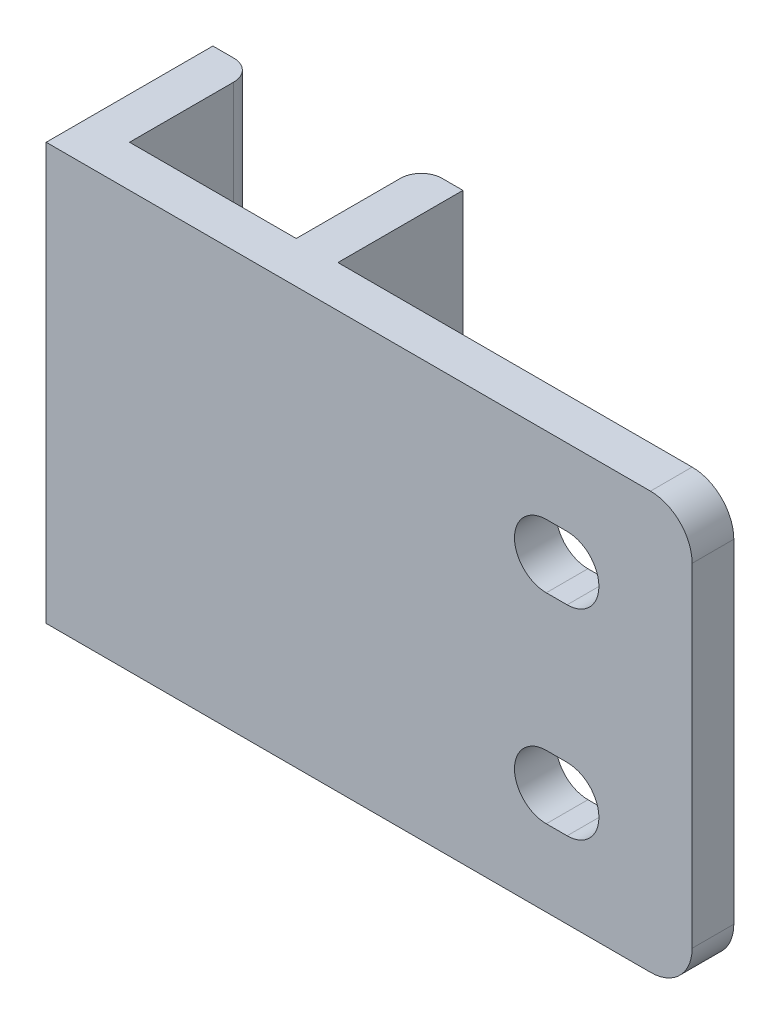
ISO-10303-21;
HEADER;
FILE_DESCRIPTION(('STEP AP214'),'2;1');
FILE_NAME('part.step','',(''),(''),'','','');
FILE_SCHEMA(('AUTOMOTIVE_DESIGN { 1 0 10303 214 1 1 1 1 }'));
ENDSEC;
DATA;
#1=APPLICATION_CONTEXT('core data for automotive mechanical design processes');
#2=APPLICATION_PROTOCOL_DEFINITION('international standard','automotive_design',2000,#1);
#3=PRODUCT_CONTEXT('',#1,'mechanical');
#4=PRODUCT('Part','Part','',(#3));
#5=PRODUCT_RELATED_PRODUCT_CATEGORY('part','',(#4));
#6=PRODUCT_DEFINITION_FORMATION('','',#4);
#7=PRODUCT_DEFINITION_CONTEXT('part definition',#1,'design');
#8=PRODUCT_DEFINITION('design','',#6,#7);
#9=PRODUCT_DEFINITION_SHAPE('','',#8);
#10=(LENGTH_UNIT() NAMED_UNIT(*) SI_UNIT(.MILLI.,.METRE.));
#11=(NAMED_UNIT(*) PLANE_ANGLE_UNIT() SI_UNIT($,.RADIAN.));
#12=(NAMED_UNIT(*) SI_UNIT($,.STERADIAN.) SOLID_ANGLE_UNIT());
#13=UNCERTAINTY_MEASURE_WITH_UNIT(LENGTH_MEASURE(1.E-05),#10,'distance_accuracy_value','');
#14=(GEOMETRIC_REPRESENTATION_CONTEXT(3) GLOBAL_UNCERTAINTY_ASSIGNED_CONTEXT((#13)) GLOBAL_UNIT_ASSIGNED_CONTEXT((#10,
#11,#12)) REPRESENTATION_CONTEXT('',''));
#15=CARTESIAN_POINT('',(0.,0.,0.));
#16=DIRECTION('',(0.,0.,1.));
#17=DIRECTION('',(1.,0.,0.));
#18=AXIS2_PLACEMENT_3D('',#15,#16,#17);
#19=CARTESIAN_POINT('',(0.,0.,0.));
#20=DIRECTION('',(0.,0.,-1.));
#21=DIRECTION('',(-1.,0.,0.));
#22=AXIS2_PLACEMENT_3D('',#19,#20,#21);
#23=PLANE('',#22);
#24=DIRECTION('',(0.,-1.,0.));
#25=VECTOR('',#24,1.);
#26=CARTESIAN_POINT('',(-20.5,10.,0.));
#27=LINE('',#26,#25);
#28=CARTESIAN_POINT('',(-20.5,10.,0.));
#29=VERTEX_POINT('',#28);
#30=CARTESIAN_POINT('',(-20.5,-10.,0.));
#31=VERTEX_POINT('',#30);
#32=EDGE_CURVE('E214',#29,#31,#27,.T.);
#33=ORIENTED_EDGE('',*,*,#32,.T.);
#34=DIRECTION('',(1.,0.,0.));
#35=VECTOR('',#34,1.);
#36=CARTESIAN_POINT('',(0.500000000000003,-10.,0.));
#37=LINE('',#36,#35);
#38=CARTESIAN_POINT('',(-28.5,-10.,0.));
#39=VERTEX_POINT('',#38);
#40=EDGE_CURVE('E303',#39,#31,#37,.T.);
#41=ORIENTED_EDGE('',*,*,#40,.F.);
#42=DIRECTION('',(0.,1.,0.));
#43=VECTOR('',#42,1.);
#44=CARTESIAN_POINT('',(-28.5,10.,0.));
#45=LINE('',#44,#43);
#46=CARTESIAN_POINT('',(-28.5,10.,0.));
#47=VERTEX_POINT('',#46);
#48=EDGE_CURVE('E220',#39,#47,#45,.T.);
#49=ORIENTED_EDGE('',*,*,#48,.T.);
#50=DIRECTION('',(-1.,0.,0.));
#51=VECTOR('',#50,1.);
#52=CARTESIAN_POINT('',(-30.5,10.,0.));
#53=LINE('',#52,#51);
#54=EDGE_CURVE('E312',#29,#47,#53,.T.);
#55=ORIENTED_EDGE('',*,*,#54,.F.);
#56=EDGE_LOOP('',(#33,#41,#49,#55));
#57=FACE_BOUND('',#56,.T.);
#58=ADVANCED_FACE('F35',(#57),#23,.T.);
#59=DIRECTION('',(0.,1.,0.));
#60=VECTOR('',#59,1.);
#61=CARTESIAN_POINT('',(0.499999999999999,10.,0.));
#62=LINE('',#61,#60);
#63=CARTESIAN_POINT('',(0.500000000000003,-8.,0.));
#64=VERTEX_POINT('',#63);
#65=CARTESIAN_POINT('',(0.5,8.,0.));
#66=VERTEX_POINT('',#65);
#67=EDGE_CURVE('E299',#64,#66,#62,.T.);
#68=ORIENTED_EDGE('',*,*,#67,.F.);
#69=CARTESIAN_POINT('',(-1.5,-8.,0.));
#70=DIRECTION('',(0.,0.,-1.));
#71=DIRECTION('',(-1.,0.,0.));
#72=AXIS2_PLACEMENT_3D('',#69,#70,#71);
#73=CIRCLE('',#72,2.);
#74=CARTESIAN_POINT('',(-1.5,-10.,0.));
#75=VERTEX_POINT('',#74);
#76=EDGE_CURVE('E346',#64,#75,#73,.T.);
#77=ORIENTED_EDGE('',*,*,#76,.T.);
#78=CARTESIAN_POINT('',(-18.5,-10.,0.));
#79=VERTEX_POINT('',#78);
#80=EDGE_CURVE('E315',#79,#75,#37,.T.);
#81=ORIENTED_EDGE('',*,*,#80,.F.);
#82=DIRECTION('',(0.,1.,0.));
#83=VECTOR('',#82,1.);
#84=CARTESIAN_POINT('',(-18.5,10.,0.));
#85=LINE('',#84,#83);
#86=CARTESIAN_POINT('',(-18.5,10.,0.));
#87=VERTEX_POINT('',#86);
#88=EDGE_CURVE('E197',#79,#87,#85,.T.);
#89=ORIENTED_EDGE('',*,*,#88,.T.);
#90=CARTESIAN_POINT('',(-1.5,10.,0.));
#91=VERTEX_POINT('',#90);
#92=EDGE_CURVE('E313',#91,#87,#53,.T.);
#93=ORIENTED_EDGE('',*,*,#92,.F.);
#94=CARTESIAN_POINT('',(-1.5,8.,0.));
#95=DIRECTION('',(0.,0.,-1.));
#96=DIRECTION('',(-1.,0.,0.));
#97=AXIS2_PLACEMENT_3D('',#94,#95,#96);
#98=CIRCLE('',#97,2.);
#99=EDGE_CURVE('E344',#91,#66,#98,.T.);
#100=ORIENTED_EDGE('',*,*,#99,.T.);
#101=EDGE_LOOP('',(#68,#77,#81,#89,#93,#100));
#102=FACE_BOUND('',#101,.T.);
#103=DIRECTION('',(-1.,0.,0.));
#104=VECTOR('',#103,1.);
#105=CARTESIAN_POINT('',(-6.5,6.325,0.));
#106=LINE('',#105,#104);
#107=CARTESIAN_POINT('',(-5.5,6.325,0.));
#108=VERTEX_POINT('',#107);
#109=CARTESIAN_POINT('',(-6.5,6.325,0.));
#110=VERTEX_POINT('',#109);
#111=EDGE_CURVE('E272',#108,#110,#106,.T.);
#112=ORIENTED_EDGE('',*,*,#111,.T.);
#113=CARTESIAN_POINT('',(-6.5,4.8,0.));
#114=DIRECTION('',(0.,0.,1.));
#115=DIRECTION('',(1.,0.,0.));
#116=AXIS2_PLACEMENT_3D('',#113,#114,#115);
#117=CIRCLE('',#116,1.525);
#118=CARTESIAN_POINT('',(-6.5,3.275,0.));
#119=VERTEX_POINT('',#118);
#120=EDGE_CURVE('E268',#110,#119,#117,.T.);
#121=ORIENTED_EDGE('',*,*,#120,.T.);
#122=DIRECTION('',(1.,0.,0.));
#123=VECTOR('',#122,1.);
#124=CARTESIAN_POINT('',(-6.5,3.275,0.));
#125=LINE('',#124,#123);
#126=CARTESIAN_POINT('',(-5.5,3.275,0.));
#127=VERTEX_POINT('',#126);
#128=EDGE_CURVE('E282',#119,#127,#125,.T.);
#129=ORIENTED_EDGE('',*,*,#128,.T.);
#130=CARTESIAN_POINT('',(-5.5,4.8,0.));
#131=DIRECTION('',(0.,0.,1.));
#132=DIRECTION('',(1.,0.,0.));
#133=AXIS2_PLACEMENT_3D('',#130,#131,#132);
#134=CIRCLE('',#133,1.525);
#135=EDGE_CURVE('E285',#127,#108,#134,.T.);
#136=ORIENTED_EDGE('',*,*,#135,.T.);
#137=EDGE_LOOP('',(#112,#121,#129,#136));
#138=FACE_BOUND('',#137,.T.);
#139=DIRECTION('',(-1.,0.,0.));
#140=VECTOR('',#139,1.);
#141=CARTESIAN_POINT('',(-6.49999999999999,-3.275,0.));
#142=LINE('',#141,#140);
#143=CARTESIAN_POINT('',(-5.5,-3.275,0.));
#144=VERTEX_POINT('',#143);
#145=CARTESIAN_POINT('',(-6.49999999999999,-3.275,0.));
#146=VERTEX_POINT('',#145);
#147=EDGE_CURVE('E241',#144,#146,#142,.T.);
#148=ORIENTED_EDGE('',*,*,#147,.T.);
#149=CARTESIAN_POINT('',(-6.49999999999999,-4.8,0.));
#150=DIRECTION('',(0.,0.,1.));
#151=DIRECTION('',(1.,0.,0.));
#152=AXIS2_PLACEMENT_3D('',#149,#150,#151);
#153=CIRCLE('',#152,1.525);
#154=CARTESIAN_POINT('',(-6.49999999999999,-6.325,0.));
#155=VERTEX_POINT('',#154);
#156=EDGE_CURVE('E236',#146,#155,#153,.T.);
#157=ORIENTED_EDGE('',*,*,#156,.T.);
#158=DIRECTION('',(1.,0.,0.));
#159=VECTOR('',#158,1.);
#160=CARTESIAN_POINT('',(-6.49999999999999,-6.325,0.));
#161=LINE('',#160,#159);
#162=CARTESIAN_POINT('',(-5.5,-6.325,0.));
#163=VERTEX_POINT('',#162);
#164=EDGE_CURVE('E251',#155,#163,#161,.T.);
#165=ORIENTED_EDGE('',*,*,#164,.T.);
#166=CARTESIAN_POINT('',(-5.49999999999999,-4.8,0.));
#167=DIRECTION('',(0.,0.,1.));
#168=DIRECTION('',(1.,0.,0.));
#169=AXIS2_PLACEMENT_3D('',#166,#167,#168);
#170=CIRCLE('',#169,1.525);
#171=EDGE_CURVE('E254',#163,#144,#170,.T.);
#172=ORIENTED_EDGE('',*,*,#171,.T.);
#173=EDGE_LOOP('',(#148,#157,#165,#172));
#174=FACE_BOUND('',#173,.T.);
#175=ADVANCED_FACE('F361',(#102,#138,#174),#23,.T.);
#176=CARTESIAN_POINT('',(0.,0.,2.));
#177=DIRECTION('',(0.,0.,-1.));
#178=DIRECTION('',(-1.,0.,0.));
#179=AXIS2_PLACEMENT_3D('',#176,#177,#178);
#180=PLANE('',#179);
#181=CARTESIAN_POINT('',(-6.5,4.8,2.));
#182=DIRECTION('',(0.,0.,1.));
#183=DIRECTION('',(1.,0.,0.));
#184=AXIS2_PLACEMENT_3D('',#181,#182,#183);
#185=CIRCLE('',#184,1.525);
#186=CARTESIAN_POINT('',(-6.5,6.325,2.));
#187=VERTEX_POINT('',#186);
#188=CARTESIAN_POINT('',(-6.5,3.275,2.));
#189=VERTEX_POINT('',#188);
#190=EDGE_CURVE('E269',#187,#189,#185,.T.);
#191=ORIENTED_EDGE('',*,*,#190,.F.);
#192=DIRECTION('',(-1.,0.,0.));
#193=VECTOR('',#192,1.);
#194=CARTESIAN_POINT('',(-6.5,6.325,2.));
#195=LINE('',#194,#193);
#196=CARTESIAN_POINT('',(-5.5,6.325,2.));
#197=VERTEX_POINT('',#196);
#198=EDGE_CURVE('E277',#197,#187,#195,.T.);
#199=ORIENTED_EDGE('',*,*,#198,.F.);
#200=CARTESIAN_POINT('',(-5.5,4.8,2.));
#201=DIRECTION('',(0.,0.,1.));
#202=DIRECTION('',(1.,0.,0.));
#203=AXIS2_PLACEMENT_3D('',#200,#201,#202);
#204=CIRCLE('',#203,1.525);
#205=CARTESIAN_POINT('',(-5.5,3.275,2.));
#206=VERTEX_POINT('',#205);
#207=EDGE_CURVE('E274',#206,#197,#204,.T.);
#208=ORIENTED_EDGE('',*,*,#207,.F.);
#209=DIRECTION('',(1.,0.,0.));
#210=VECTOR('',#209,1.);
#211=CARTESIAN_POINT('',(-6.5,3.275,2.));
#212=LINE('',#211,#210);
#213=EDGE_CURVE('E271',#189,#206,#212,.T.);
#214=ORIENTED_EDGE('',*,*,#213,.F.);
#215=EDGE_LOOP('',(#191,#199,#208,#214));
#216=FACE_BOUND('',#215,.T.);
#217=DIRECTION('',(1.,0.,0.));
#218=VECTOR('',#217,1.);
#219=CARTESIAN_POINT('',(0.500000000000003,-10.,2.));
#220=LINE('',#219,#218);
#221=CARTESIAN_POINT('',(-30.5,-10.,2.));
#222=VERTEX_POINT('',#221);
#223=CARTESIAN_POINT('',(-1.5,-10.,2.));
#224=VERTEX_POINT('',#223);
#225=EDGE_CURVE('E307',#222,#224,#220,.T.);
#226=ORIENTED_EDGE('',*,*,#225,.T.);
#227=CARTESIAN_POINT('',(-1.5,-8.,2.));
#228=DIRECTION('',(0.,0.,-1.));
#229=DIRECTION('',(-1.,0.,0.));
#230=AXIS2_PLACEMENT_3D('',#227,#228,#229);
#231=CIRCLE('',#230,2.);
#232=CARTESIAN_POINT('',(0.500000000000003,-8.,2.));
#233=VERTEX_POINT('',#232);
#234=EDGE_CURVE('E43',#224,#233,#231,.F.);
#235=ORIENTED_EDGE('',*,*,#234,.T.);
#236=DIRECTION('',(0.,1.,0.));
#237=VECTOR('',#236,1.);
#238=CARTESIAN_POINT('',(0.499999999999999,10.,2.));
#239=LINE('',#238,#237);
#240=CARTESIAN_POINT('',(0.5,8.,2.));
#241=VERTEX_POINT('',#240);
#242=EDGE_CURVE('E300',#233,#241,#239,.T.);
#243=ORIENTED_EDGE('',*,*,#242,.T.);
#244=CARTESIAN_POINT('',(-1.5,8.,2.));
#245=DIRECTION('',(0.,0.,-1.));
#246=DIRECTION('',(-1.,0.,0.));
#247=AXIS2_PLACEMENT_3D('',#244,#245,#246);
#248=CIRCLE('',#247,2.);
#249=CARTESIAN_POINT('',(-1.5,10.,2.));
#250=VERTEX_POINT('',#249);
#251=EDGE_CURVE('E50',#241,#250,#248,.F.);
#252=ORIENTED_EDGE('',*,*,#251,.T.);
#253=DIRECTION('',(-1.,0.,0.));
#254=VECTOR('',#253,1.);
#255=CARTESIAN_POINT('',(-30.5,10.,2.));
#256=LINE('',#255,#254);
#257=CARTESIAN_POINT('',(-30.5,10.,2.));
#258=VERTEX_POINT('',#257);
#259=EDGE_CURVE('E302',#250,#258,#256,.T.);
#260=ORIENTED_EDGE('',*,*,#259,.T.);
#261=DIRECTION('',(0.,-1.,0.));
#262=VECTOR('',#261,1.);
#263=CARTESIAN_POINT('',(-30.5,10.,2.));
#264=LINE('',#263,#262);
#265=EDGE_CURVE('E305',#258,#222,#264,.T.);
#266=ORIENTED_EDGE('',*,*,#265,.T.);
#267=EDGE_LOOP('',(#226,#235,#243,#252,#260,#266));
#268=FACE_BOUND('',#267,.T.);
#269=CARTESIAN_POINT('',(-6.49999999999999,-4.8,2.));
#270=DIRECTION('',(0.,0.,1.));
#271=DIRECTION('',(1.,0.,0.));
#272=AXIS2_PLACEMENT_3D('',#269,#270,#271);
#273=CIRCLE('',#272,1.525);
#274=CARTESIAN_POINT('',(-6.49999999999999,-3.275,2.));
#275=VERTEX_POINT('',#274);
#276=CARTESIAN_POINT('',(-6.49999999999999,-6.325,2.));
#277=VERTEX_POINT('',#276);
#278=EDGE_CURVE('E238',#275,#277,#273,.T.);
#279=ORIENTED_EDGE('',*,*,#278,.F.);
#280=DIRECTION('',(-1.,0.,0.));
#281=VECTOR('',#280,1.);
#282=CARTESIAN_POINT('',(-6.49999999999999,-3.275,2.));
#283=LINE('',#282,#281);
#284=CARTESIAN_POINT('',(-5.5,-3.275,2.));
#285=VERTEX_POINT('',#284);
#286=EDGE_CURVE('E246',#285,#275,#283,.T.);
#287=ORIENTED_EDGE('',*,*,#286,.F.);
#288=CARTESIAN_POINT('',(-5.49999999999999,-4.8,2.));
#289=DIRECTION('',(0.,0.,1.));
#290=DIRECTION('',(1.,0.,0.));
#291=AXIS2_PLACEMENT_3D('',#288,#289,#290);
#292=CIRCLE('',#291,1.525);
#293=CARTESIAN_POINT('',(-5.5,-6.325,2.));
#294=VERTEX_POINT('',#293);
#295=EDGE_CURVE('E243',#294,#285,#292,.T.);
#296=ORIENTED_EDGE('',*,*,#295,.F.);
#297=DIRECTION('',(1.,0.,0.));
#298=VECTOR('',#297,1.);
#299=CARTESIAN_POINT('',(-6.49999999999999,-6.325,2.));
#300=LINE('',#299,#298);
#301=EDGE_CURVE('E240',#277,#294,#300,.T.);
#302=ORIENTED_EDGE('',*,*,#301,.F.);
#303=EDGE_LOOP('',(#279,#287,#296,#302));
#304=FACE_BOUND('',#303,.T.);
#305=ADVANCED_FACE('F351',(#216,#268,#304),#180,.F.);
#306=CARTESIAN_POINT('',(0.499999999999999,10.,2.));
#307=DIRECTION('',(-1.,0.,0.));
#308=DIRECTION('',(0.,-1.,0.));
#309=AXIS2_PLACEMENT_3D('',#306,#307,#308);
#310=PLANE('',#309);
#311=ORIENTED_EDGE('',*,*,#242,.F.);
#312=DIRECTION('',(0.,0.,-1.));
#313=VECTOR('',#312,1.);
#314=CARTESIAN_POINT('',(0.500000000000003,-8.,2.));
#315=LINE('',#314,#313);
#316=EDGE_CURVE('E341',#233,#64,#315,.T.);
#317=ORIENTED_EDGE('',*,*,#316,.T.);
#318=ORIENTED_EDGE('',*,*,#67,.T.);
#319=DIRECTION('',(0.,0.,-1.));
#320=VECTOR('',#319,1.);
#321=CARTESIAN_POINT('',(0.5,8.,2.));
#322=LINE('',#321,#320);
#323=EDGE_CURVE('E339',#66,#241,#322,.F.);
#324=ORIENTED_EDGE('',*,*,#323,.T.);
#325=EDGE_LOOP('',(#311,#317,#318,#324));
#326=FACE_BOUND('',#325,.T.);
#327=ADVANCED_FACE('F356',(#326),#310,.F.);
#328=CARTESIAN_POINT('',(-30.5,10.,2.));
#329=DIRECTION('',(0.,-1.,0.));
#330=DIRECTION('',(1.,0.,0.));
#331=AXIS2_PLACEMENT_3D('',#328,#329,#330);
#332=PLANE('',#331);
#333=ORIENTED_EDGE('',*,*,#259,.F.);
#334=DIRECTION('',(0.,0.,-1.));
#335=VECTOR('',#334,1.);
#336=CARTESIAN_POINT('',(-1.5,10.,2.));
#337=LINE('',#336,#335);
#338=EDGE_CURVE('E11',#250,#91,#337,.T.);
#339=ORIENTED_EDGE('',*,*,#338,.T.);
#340=ORIENTED_EDGE('',*,*,#92,.T.);
#341=DIRECTION('',(0.,0.,1.));
#342=VECTOR('',#341,1.);
#343=CARTESIAN_POINT('',(-18.5,10.,-6.));
#344=LINE('',#343,#342);
#345=CARTESIAN_POINT('',(-18.5,10.,-6.));
#346=VERTEX_POINT('',#345);
#347=EDGE_CURVE('E205',#346,#87,#344,.T.);
#348=ORIENTED_EDGE('',*,*,#347,.F.);
#349=DIRECTION('',(-1.,0.,0.));
#350=VECTOR('',#349,1.);
#351=CARTESIAN_POINT('',(-20.5,10.,-6.));
#352=LINE('',#351,#350);
#353=CARTESIAN_POINT('',(-19.5,10.,-6.));
#354=VERTEX_POINT('',#353);
#355=EDGE_CURVE('E210',#346,#354,#352,.T.);
#356=ORIENTED_EDGE('',*,*,#355,.T.);
#357=CARTESIAN_POINT('',(-19.5,10.,-5.));
#358=DIRECTION('',(0.,-1.,0.));
#359=DIRECTION('',(1.,0.,0.));
#360=AXIS2_PLACEMENT_3D('',#357,#358,#359);
#361=CIRCLE('',#360,1.);
#362=CARTESIAN_POINT('',(-20.5,10.,-5.));
#363=VERTEX_POINT('',#362);
#364=EDGE_CURVE('E325',#354,#363,#361,.F.);
#365=ORIENTED_EDGE('',*,*,#364,.T.);
#366=DIRECTION('',(0.,0.,1.));
#367=VECTOR('',#366,1.);
#368=CARTESIAN_POINT('',(-20.5,10.,-6.));
#369=LINE('',#368,#367);
#370=EDGE_CURVE('E218',#363,#29,#369,.T.);
#371=ORIENTED_EDGE('',*,*,#370,.T.);
#372=ORIENTED_EDGE('',*,*,#54,.T.);
#373=DIRECTION('',(0.,0.,1.));
#374=VECTOR('',#373,1.);
#375=CARTESIAN_POINT('',(-28.5,10.,-6.));
#376=LINE('',#375,#374);
#377=CARTESIAN_POINT('',(-28.5,10.,-5.));
#378=VERTEX_POINT('',#377);
#379=EDGE_CURVE('E234',#378,#47,#376,.T.);
#380=ORIENTED_EDGE('',*,*,#379,.F.);
#381=CARTESIAN_POINT('',(-29.5,10.,-5.));
#382=DIRECTION('',(0.,-1.,0.));
#383=DIRECTION('',(1.,0.,0.));
#384=AXIS2_PLACEMENT_3D('',#381,#382,#383);
#385=CIRCLE('',#384,1.);
#386=CARTESIAN_POINT('',(-29.5,10.,-6.));
#387=VERTEX_POINT('',#386);
#388=EDGE_CURVE('E327',#378,#387,#385,.F.);
#389=ORIENTED_EDGE('',*,*,#388,.T.);
#390=DIRECTION('',(-1.,0.,0.));
#391=VECTOR('',#390,1.);
#392=CARTESIAN_POINT('',(-30.5,10.,-6.));
#393=LINE('',#392,#391);
#394=CARTESIAN_POINT('',(-30.5,10.,-6.));
#395=VERTEX_POINT('',#394);
#396=EDGE_CURVE('E229',#387,#395,#393,.T.);
#397=ORIENTED_EDGE('',*,*,#396,.T.);
#398=DIRECTION('',(0.,0.,-1.));
#399=VECTOR('',#398,1.);
#400=CARTESIAN_POINT('',(-30.5,10.,2.));
#401=LINE('',#400,#399);
#402=EDGE_CURVE('E319',#258,#395,#401,.T.);
#403=ORIENTED_EDGE('',*,*,#402,.F.);
#404=EDGE_LOOP('',(#333,#339,#340,#348,#356,#365,#371,#372,#380,#389,#397,#403));
#405=FACE_BOUND('',#404,.T.);
#406=ADVANCED_FACE('F367',(#405),#332,.F.);
#407=CARTESIAN_POINT('',(-30.5,10.,2.));
#408=DIRECTION('',(1.,0.,0.));
#409=DIRECTION('',(0.,1.,0.));
#410=AXIS2_PLACEMENT_3D('',#407,#408,#409);
#411=PLANE('',#410);
#412=ORIENTED_EDGE('',*,*,#402,.T.);
#413=DIRECTION('',(0.,-1.,0.));
#414=VECTOR('',#413,1.);
#415=CARTESIAN_POINT('',(-30.5,10.,-6.));
#416=LINE('',#415,#414);
#417=CARTESIAN_POINT('',(-30.5,-10.,-6.));
#418=VERTEX_POINT('',#417);
#419=EDGE_CURVE('E223',#395,#418,#416,.T.);
#420=ORIENTED_EDGE('',*,*,#419,.T.);
#421=DIRECTION('',(0.,0.,-1.));
#422=VECTOR('',#421,1.);
#423=CARTESIAN_POINT('',(-30.5,-10.,2.));
#424=LINE('',#423,#422);
#425=EDGE_CURVE('E309',#222,#418,#424,.T.);
#426=ORIENTED_EDGE('',*,*,#425,.F.);
#427=ORIENTED_EDGE('',*,*,#265,.F.);
#428=EDGE_LOOP('',(#412,#420,#426,#427));
#429=FACE_BOUND('',#428,.T.);
#430=ADVANCED_FACE('F372',(#429),#411,.F.);
#431=CARTESIAN_POINT('',(0.500000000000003,-10.,2.));
#432=DIRECTION('',(0.,1.,0.));
#433=DIRECTION('',(0.,0.,1.));
#434=AXIS2_PLACEMENT_3D('',#431,#432,#433);
#435=PLANE('',#434);
#436=ORIENTED_EDGE('',*,*,#80,.T.);
#437=DIRECTION('',(0.,0.,-1.));
#438=VECTOR('',#437,1.);
#439=CARTESIAN_POINT('',(-1.5,-10.,2.));
#440=LINE('',#439,#438);
#441=EDGE_CURVE('E58',#75,#224,#440,.F.);
#442=ORIENTED_EDGE('',*,*,#441,.T.);
#443=ORIENTED_EDGE('',*,*,#225,.F.);
#444=ORIENTED_EDGE('',*,*,#425,.T.);
#445=DIRECTION('',(1.,0.,0.));
#446=VECTOR('',#445,1.);
#447=CARTESIAN_POINT('',(-30.5,-10.,-6.));
#448=LINE('',#447,#446);
#449=CARTESIAN_POINT('',(-29.5,-10.,-6.));
#450=VERTEX_POINT('',#449);
#451=EDGE_CURVE('E226',#418,#450,#448,.T.);
#452=ORIENTED_EDGE('',*,*,#451,.T.);
#453=CARTESIAN_POINT('',(-29.5,-10.,-5.));
#454=DIRECTION('',(0.,1.,0.));
#455=DIRECTION('',(0.,0.,1.));
#456=AXIS2_PLACEMENT_3D('',#453,#454,#455);
#457=CIRCLE('',#456,1.);
#458=CARTESIAN_POINT('',(-28.5,-10.,-5.));
#459=VERTEX_POINT('',#458);
#460=EDGE_CURVE('E332',#450,#459,#457,.F.);
#461=ORIENTED_EDGE('',*,*,#460,.T.);
#462=DIRECTION('',(0.,0.,1.));
#463=VECTOR('',#462,1.);
#464=CARTESIAN_POINT('',(-28.5,-10.,-6.));
#465=LINE('',#464,#463);
#466=EDGE_CURVE('E231',#459,#39,#465,.T.);
#467=ORIENTED_EDGE('',*,*,#466,.T.);
#468=ORIENTED_EDGE('',*,*,#40,.T.);
#469=DIRECTION('',(0.,0.,1.));
#470=VECTOR('',#469,1.);
#471=CARTESIAN_POINT('',(-20.5,-10.,-6.));
#472=LINE('',#471,#470);
#473=CARTESIAN_POINT('',(-20.5,-10.,-5.));
#474=VERTEX_POINT('',#473);
#475=EDGE_CURVE('E206',#474,#31,#472,.T.);
#476=ORIENTED_EDGE('',*,*,#475,.F.);
#477=CARTESIAN_POINT('',(-19.5,-10.,-5.));
#478=DIRECTION('',(0.,1.,0.));
#479=DIRECTION('',(0.,0.,1.));
#480=AXIS2_PLACEMENT_3D('',#477,#478,#479);
#481=CIRCLE('',#480,1.);
#482=CARTESIAN_POINT('',(-19.5,-10.,-6.));
#483=VERTEX_POINT('',#482);
#484=EDGE_CURVE('E192',#474,#483,#481,.F.);
#485=ORIENTED_EDGE('',*,*,#484,.T.);
#486=DIRECTION('',(1.,0.,0.));
#487=VECTOR('',#486,1.);
#488=CARTESIAN_POINT('',(-20.5,-10.,-6.));
#489=LINE('',#488,#487);
#490=CARTESIAN_POINT('',(-18.5,-10.,-6.));
#491=VERTEX_POINT('',#490);
#492=EDGE_CURVE('E186',#483,#491,#489,.T.);
#493=ORIENTED_EDGE('',*,*,#492,.T.);
#494=DIRECTION('',(0.,0.,1.));
#495=VECTOR('',#494,1.);
#496=CARTESIAN_POINT('',(-18.5,-10.,-6.));
#497=LINE('',#496,#495);
#498=EDGE_CURVE('E189',#491,#79,#497,.T.);
#499=ORIENTED_EDGE('',*,*,#498,.T.);
#500=EDGE_LOOP('',(#436,#442,#443,#444,#452,#461,#467,#468,#476,#485,#493,#499));
#501=FACE_BOUND('',#500,.T.);
#502=ADVANCED_FACE('F188',(#501),#435,.F.);
#503=CARTESIAN_POINT('',(-6.5,4.8,2.));
#504=DIRECTION('',(0.,0.,-1.));
#505=DIRECTION('',(-1.,0.,0.));
#506=AXIS2_PLACEMENT_3D('',#503,#504,#505);
#507=CYLINDRICAL_SURFACE('',#506,1.525);
#508=ORIENTED_EDGE('',*,*,#120,.F.);
#509=DIRECTION('',(0.,0.,-1.));
#510=VECTOR('',#509,1.);
#511=CARTESIAN_POINT('',(-6.5,6.325,2.));
#512=LINE('',#511,#510);
#513=EDGE_CURVE('E279',#187,#110,#512,.T.);
#514=ORIENTED_EDGE('',*,*,#513,.F.);
#515=ORIENTED_EDGE('',*,*,#190,.T.);
#516=DIRECTION('',(0.,0.,-1.));
#517=VECTOR('',#516,1.);
#518=CARTESIAN_POINT('',(-6.5,3.275,2.));
#519=LINE('',#518,#517);
#520=EDGE_CURVE('E296',#189,#119,#519,.T.);
#521=ORIENTED_EDGE('',*,*,#520,.T.);
#522=EDGE_LOOP('',(#508,#514,#515,#521));
#523=FACE_BOUND('',#522,.T.);
#524=ADVANCED_FACE('F417',(#523),#507,.F.);
#525=CARTESIAN_POINT('',(-6.5,3.275,2.));
#526=DIRECTION('',(0.,1.,0.));
#527=DIRECTION('',(0.,0.,1.));
#528=AXIS2_PLACEMENT_3D('',#525,#526,#527);
#529=PLANE('',#528);
#530=ORIENTED_EDGE('',*,*,#128,.F.);
#531=ORIENTED_EDGE('',*,*,#520,.F.);
#532=ORIENTED_EDGE('',*,*,#213,.T.);
#533=DIRECTION('',(0.,0.,-1.));
#534=VECTOR('',#533,1.);
#535=CARTESIAN_POINT('',(-5.5,3.275,2.));
#536=LINE('',#535,#534);
#537=EDGE_CURVE('E294',#206,#127,#536,.T.);
#538=ORIENTED_EDGE('',*,*,#537,.T.);
#539=EDGE_LOOP('',(#530,#531,#532,#538));
#540=FACE_BOUND('',#539,.T.);
#541=ADVANCED_FACE('F437',(#540),#529,.T.);
#542=CARTESIAN_POINT('',(-5.5,4.8,2.));
#543=DIRECTION('',(0.,0.,-1.));
#544=DIRECTION('',(-1.,0.,0.));
#545=AXIS2_PLACEMENT_3D('',#542,#543,#544);
#546=CYLINDRICAL_SURFACE('',#545,1.525);
#547=ORIENTED_EDGE('',*,*,#135,.F.);
#548=ORIENTED_EDGE('',*,*,#537,.F.);
#549=ORIENTED_EDGE('',*,*,#207,.T.);
#550=DIRECTION('',(0.,0.,-1.));
#551=VECTOR('',#550,1.);
#552=CARTESIAN_POINT('',(-5.5,6.325,2.));
#553=LINE('',#552,#551);
#554=EDGE_CURVE('E292',#197,#108,#553,.T.);
#555=ORIENTED_EDGE('',*,*,#554,.T.);
#556=EDGE_LOOP('',(#547,#548,#549,#555));
#557=FACE_BOUND('',#556,.T.);
#558=ADVANCED_FACE('F445',(#557),#546,.F.);
#559=CARTESIAN_POINT('',(-6.5,6.325,2.));
#560=DIRECTION('',(0.,-1.,0.));
#561=DIRECTION('',(0.,0.,-1.));
#562=AXIS2_PLACEMENT_3D('',#559,#560,#561);
#563=PLANE('',#562);
#564=ORIENTED_EDGE('',*,*,#111,.F.);
#565=ORIENTED_EDGE('',*,*,#554,.F.);
#566=ORIENTED_EDGE('',*,*,#198,.T.);
#567=ORIENTED_EDGE('',*,*,#513,.T.);
#568=EDGE_LOOP('',(#564,#565,#566,#567));
#569=FACE_BOUND('',#568,.T.);
#570=ADVANCED_FACE('F443',(#569),#563,.T.);
#571=CARTESIAN_POINT('',(-6.49999999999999,-4.8,2.));
#572=DIRECTION('',(0.,0.,-1.));
#573=DIRECTION('',(-1.,0.,0.));
#574=AXIS2_PLACEMENT_3D('',#571,#572,#573);
#575=CYLINDRICAL_SURFACE('',#574,1.525);
#576=ORIENTED_EDGE('',*,*,#156,.F.);
#577=DIRECTION('',(0.,0.,-1.));
#578=VECTOR('',#577,1.);
#579=CARTESIAN_POINT('',(-6.49999999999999,-3.275,2.));
#580=LINE('',#579,#578);
#581=EDGE_CURVE('E248',#275,#146,#580,.T.);
#582=ORIENTED_EDGE('',*,*,#581,.F.);
#583=ORIENTED_EDGE('',*,*,#278,.T.);
#584=DIRECTION('',(0.,0.,-1.));
#585=VECTOR('',#584,1.);
#586=CARTESIAN_POINT('',(-6.49999999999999,-6.325,2.));
#587=LINE('',#586,#585);
#588=EDGE_CURVE('E265',#277,#155,#587,.T.);
#589=ORIENTED_EDGE('',*,*,#588,.T.);
#590=EDGE_LOOP('',(#576,#582,#583,#589));
#591=FACE_BOUND('',#590,.T.);
#592=ADVANCED_FACE('F452',(#591),#575,.F.);
#593=CARTESIAN_POINT('',(-6.49999999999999,-6.325,2.));
#594=DIRECTION('',(0.,1.,0.));
#595=DIRECTION('',(0.,0.,1.));
#596=AXIS2_PLACEMENT_3D('',#593,#594,#595);
#597=PLANE('',#596);
#598=ORIENTED_EDGE('',*,*,#164,.F.);
#599=ORIENTED_EDGE('',*,*,#588,.F.);
#600=ORIENTED_EDGE('',*,*,#301,.T.);
#601=DIRECTION('',(0.,0.,-1.));
#602=VECTOR('',#601,1.);
#603=CARTESIAN_POINT('',(-5.5,-6.325,2.));
#604=LINE('',#603,#602);
#605=EDGE_CURVE('E263',#294,#163,#604,.T.);
#606=ORIENTED_EDGE('',*,*,#605,.T.);
#607=EDGE_LOOP('',(#598,#599,#600,#606));
#608=FACE_BOUND('',#607,.T.);
#609=ADVANCED_FACE('F484',(#608),#597,.T.);
#610=CARTESIAN_POINT('',(-5.49999999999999,-4.8,2.));
#611=DIRECTION('',(0.,0.,-1.));
#612=DIRECTION('',(-1.,0.,0.));
#613=AXIS2_PLACEMENT_3D('',#610,#611,#612);
#614=CYLINDRICAL_SURFACE('',#613,1.525);
#615=ORIENTED_EDGE('',*,*,#171,.F.);
#616=ORIENTED_EDGE('',*,*,#605,.F.);
#617=ORIENTED_EDGE('',*,*,#295,.T.);
#618=DIRECTION('',(0.,0.,-1.));
#619=VECTOR('',#618,1.);
#620=CARTESIAN_POINT('',(-5.5,-3.275,2.));
#621=LINE('',#620,#619);
#622=EDGE_CURVE('E261',#285,#144,#621,.T.);
#623=ORIENTED_EDGE('',*,*,#622,.T.);
#624=EDGE_LOOP('',(#615,#616,#617,#623));
#625=FACE_BOUND('',#624,.T.);
#626=ADVANCED_FACE('F493',(#625),#614,.F.);
#627=CARTESIAN_POINT('',(-6.49999999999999,-3.275,2.));
#628=DIRECTION('',(0.,-1.,0.));
#629=DIRECTION('',(0.,0.,-1.));
#630=AXIS2_PLACEMENT_3D('',#627,#628,#629);
#631=PLANE('',#630);
#632=ORIENTED_EDGE('',*,*,#147,.F.);
#633=ORIENTED_EDGE('',*,*,#622,.F.);
#634=ORIENTED_EDGE('',*,*,#286,.T.);
#635=ORIENTED_EDGE('',*,*,#581,.T.);
#636=EDGE_LOOP('',(#632,#633,#634,#635));
#637=FACE_BOUND('',#636,.T.);
#638=ADVANCED_FACE('F503',(#637),#631,.T.);
#639=CARTESIAN_POINT('',(-28.5,10.,-6.));
#640=DIRECTION('',(1.,0.,0.));
#641=DIRECTION('',(0.,0.,-1.));
#642=AXIS2_PLACEMENT_3D('',#639,#640,#641);
#643=PLANE('',#642);
#644=ORIENTED_EDGE('',*,*,#466,.F.);
#645=DIRECTION('',(0.,1.,0.));
#646=VECTOR('',#645,1.);
#647=CARTESIAN_POINT('',(-28.5,10.,-5.));
#648=LINE('',#647,#646);
#649=EDGE_CURVE('E322',#459,#378,#648,.T.);
#650=ORIENTED_EDGE('',*,*,#649,.T.);
#651=ORIENTED_EDGE('',*,*,#379,.T.);
#652=ORIENTED_EDGE('',*,*,#48,.F.);
#653=EDGE_LOOP('',(#644,#650,#651,#652));
#654=FACE_BOUND('',#653,.T.);
#655=ADVANCED_FACE('F386',(#654),#643,.T.);
#656=CARTESIAN_POINT('',(0.,0.,-6.));
#657=DIRECTION('',(0.,0.,1.));
#658=DIRECTION('',(1.,0.,0.));
#659=AXIS2_PLACEMENT_3D('',#656,#657,#658);
#660=PLANE('',#659);
#661=ORIENTED_EDGE('',*,*,#396,.F.);
#662=DIRECTION('',(0.,1.,0.));
#663=VECTOR('',#662,1.);
#664=CARTESIAN_POINT('',(-29.5,-10.,-6.));
#665=LINE('',#664,#663);
#666=EDGE_CURVE('E329',#387,#450,#665,.F.);
#667=ORIENTED_EDGE('',*,*,#666,.T.);
#668=ORIENTED_EDGE('',*,*,#451,.F.);
#669=ORIENTED_EDGE('',*,*,#419,.F.);
#670=EDGE_LOOP('',(#661,#667,#668,#669));
#671=FACE_BOUND('',#670,.T.);
#672=ADVANCED_FACE('F378',(#671),#660,.F.);
#673=CARTESIAN_POINT('',(-20.5,10.,-6.));
#674=DIRECTION('',(-1.,0.,0.));
#675=DIRECTION('',(0.,-1.,0.));
#676=AXIS2_PLACEMENT_3D('',#673,#674,#675);
#677=PLANE('',#676);
#678=ORIENTED_EDGE('',*,*,#370,.F.);
#679=DIRECTION('',(0.,-1.,0.));
#680=VECTOR('',#679,1.);
#681=CARTESIAN_POINT('',(-20.5,-10.,-5.));
#682=LINE('',#681,#680);
#683=EDGE_CURVE('E334',#363,#474,#682,.T.);
#684=ORIENTED_EDGE('',*,*,#683,.T.);
#685=ORIENTED_EDGE('',*,*,#475,.T.);
#686=ORIENTED_EDGE('',*,*,#32,.F.);
#687=EDGE_LOOP('',(#678,#684,#685,#686));
#688=FACE_BOUND('',#687,.T.);
#689=ADVANCED_FACE('F395',(#688),#677,.T.);
#690=CARTESIAN_POINT('',(-18.5,10.,-6.));
#691=DIRECTION('',(1.,0.,0.));
#692=DIRECTION('',(0.,0.,-1.));
#693=AXIS2_PLACEMENT_3D('',#690,#691,#692);
#694=PLANE('',#693);
#695=ORIENTED_EDGE('',*,*,#88,.F.);
#696=ORIENTED_EDGE('',*,*,#498,.F.);
#697=DIRECTION('',(0.,1.,0.));
#698=VECTOR('',#697,1.);
#699=CARTESIAN_POINT('',(-18.5,10.,-6.));
#700=LINE('',#699,#698);
#701=EDGE_CURVE('E196',#491,#346,#700,.T.);
#702=ORIENTED_EDGE('',*,*,#701,.T.);
#703=ORIENTED_EDGE('',*,*,#347,.T.);
#704=EDGE_LOOP('',(#695,#696,#702,#703));
#705=FACE_BOUND('',#704,.T.);
#706=ADVANCED_FACE('F201',(#705),#694,.T.);
#707=CARTESIAN_POINT('',(0.,0.,-6.));
#708=DIRECTION('',(0.,0.,1.));
#709=DIRECTION('',(1.,0.,0.));
#710=AXIS2_PLACEMENT_3D('',#707,#708,#709);
#711=PLANE('',#710);
#712=ORIENTED_EDGE('',*,*,#492,.F.);
#713=DIRECTION('',(0.,-1.,0.));
#714=VECTOR('',#713,1.);
#715=CARTESIAN_POINT('',(-19.5,10.,-6.));
#716=LINE('',#715,#714);
#717=EDGE_CURVE('E337',#483,#354,#716,.F.);
#718=ORIENTED_EDGE('',*,*,#717,.T.);
#719=ORIENTED_EDGE('',*,*,#355,.F.);
#720=ORIENTED_EDGE('',*,*,#701,.F.);
#721=EDGE_LOOP('',(#712,#718,#719,#720));
#722=FACE_BOUND('',#721,.T.);
#723=ADVANCED_FACE('F208',(#722),#711,.F.);
#724=CARTESIAN_POINT('',(-29.5,10.,-5.));
#725=DIRECTION('',(0.,-1.,0.));
#726=DIRECTION('',(0.,0.,-1.));
#727=AXIS2_PLACEMENT_3D('',#724,#725,#726);
#728=CYLINDRICAL_SURFACE('',#727,1.);
#729=ORIENTED_EDGE('',*,*,#460,.F.);
#730=ORIENTED_EDGE('',*,*,#666,.F.);
#731=ORIENTED_EDGE('',*,*,#388,.F.);
#732=ORIENTED_EDGE('',*,*,#649,.F.);
#733=EDGE_LOOP('',(#729,#730,#731,#732));
#734=FACE_BOUND('',#733,.T.);
#735=ADVANCED_FACE('F381',(#734),#728,.T.);
#736=CARTESIAN_POINT('',(-19.5,10.,-5.));
#737=DIRECTION('',(0.,1.,0.));
#738=DIRECTION('',(-1.,0.,0.));
#739=AXIS2_PLACEMENT_3D('',#736,#737,#738);
#740=CYLINDRICAL_SURFACE('',#739,1.);
#741=ORIENTED_EDGE('',*,*,#364,.F.);
#742=ORIENTED_EDGE('',*,*,#717,.F.);
#743=ORIENTED_EDGE('',*,*,#484,.F.);
#744=ORIENTED_EDGE('',*,*,#683,.F.);
#745=EDGE_LOOP('',(#741,#742,#743,#744));
#746=FACE_BOUND('',#745,.T.);
#747=ADVANCED_FACE('F399',(#746),#740,.T.);
#748=CARTESIAN_POINT('',(-1.5,-8.,2.));
#749=DIRECTION('',(0.,0.,-1.));
#750=DIRECTION('',(-1.,0.,0.));
#751=AXIS2_PLACEMENT_3D('',#748,#749,#750);
#752=CYLINDRICAL_SURFACE('',#751,2.);
#753=ORIENTED_EDGE('',*,*,#234,.F.);
#754=ORIENTED_EDGE('',*,*,#441,.F.);
#755=ORIENTED_EDGE('',*,*,#76,.F.);
#756=ORIENTED_EDGE('',*,*,#316,.F.);
#757=EDGE_LOOP('',(#753,#754,#755,#756));
#758=FACE_BOUND('',#757,.T.);
#759=ADVANCED_FACE('F359',(#758),#752,.T.);
#760=CARTESIAN_POINT('',(-1.5,8.,2.));
#761=DIRECTION('',(0.,0.,-1.));
#762=DIRECTION('',(-1.,0.,0.));
#763=AXIS2_PLACEMENT_3D('',#760,#761,#762);
#764=CYLINDRICAL_SURFACE('',#763,2.);
#765=ORIENTED_EDGE('',*,*,#251,.F.);
#766=ORIENTED_EDGE('',*,*,#323,.F.);
#767=ORIENTED_EDGE('',*,*,#99,.F.);
#768=ORIENTED_EDGE('',*,*,#338,.F.);
#769=EDGE_LOOP('',(#765,#766,#767,#768));
#770=FACE_BOUND('',#769,.T.);
#771=ADVANCED_FACE('F37',(#770),#764,.T.);
#772=CLOSED_SHELL('',(#58,#175,#305,#327,#406,#430,#502,#524,#541,#558,#570,#592,#609,#626,#638,
#655,#672,#689,#706,#723,#735,#747,#759,#771));
#773=MANIFOLD_SOLID_BREP('B2',#772);
#774=ADVANCED_BREP_SHAPE_REPRESENTATION('',(#18,#773),#14);
#775=SHAPE_DEFINITION_REPRESENTATION(#9,#774);
ENDSEC;
END-ISO-10303-21;
